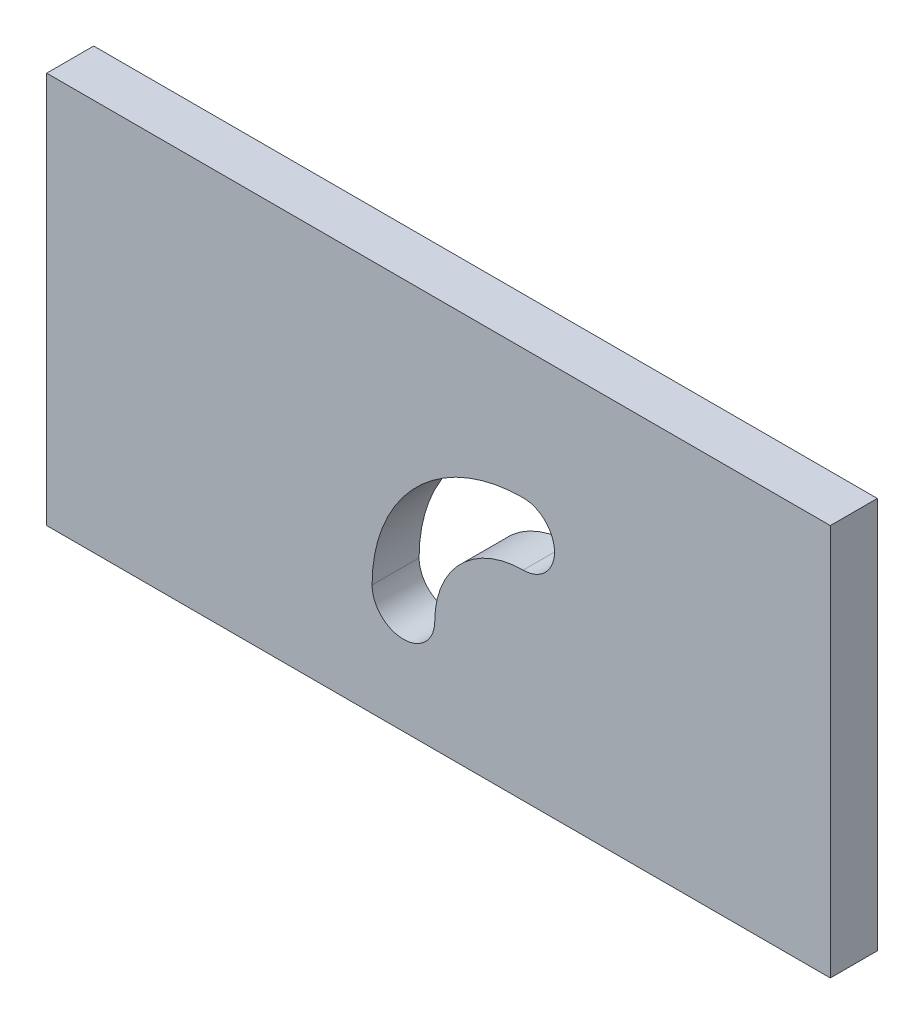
ISO-10303-21;
HEADER;
FILE_DESCRIPTION(('STEP AP214'),'2;1');
FILE_NAME('part.step','',(''),(''),'','','');
FILE_SCHEMA(('AUTOMOTIVE_DESIGN { 1 0 10303 214 1 1 1 1 }'));
ENDSEC;
DATA;
#1=APPLICATION_CONTEXT('core data for automotive mechanical design processes');
#2=APPLICATION_PROTOCOL_DEFINITION('international standard','automotive_design',2000,#1);
#3=PRODUCT_CONTEXT('',#1,'mechanical');
#4=PRODUCT('Part','Part','',(#3));
#5=PRODUCT_RELATED_PRODUCT_CATEGORY('part','',(#4));
#6=PRODUCT_DEFINITION_FORMATION('','',#4);
#7=PRODUCT_DEFINITION_CONTEXT('part definition',#1,'design');
#8=PRODUCT_DEFINITION('design','',#6,#7);
#9=PRODUCT_DEFINITION_SHAPE('','',#8);
#10=(LENGTH_UNIT() NAMED_UNIT(*) SI_UNIT(.MILLI.,.METRE.));
#11=(NAMED_UNIT(*) PLANE_ANGLE_UNIT() SI_UNIT($,.RADIAN.));
#12=(NAMED_UNIT(*) SI_UNIT($,.STERADIAN.) SOLID_ANGLE_UNIT());
#13=UNCERTAINTY_MEASURE_WITH_UNIT(LENGTH_MEASURE(1.E-05),#10,'distance_accuracy_value','');
#14=(GEOMETRIC_REPRESENTATION_CONTEXT(3) GLOBAL_UNCERTAINTY_ASSIGNED_CONTEXT((#13)) GLOBAL_UNIT_ASSIGNED_CONTEXT((#10,
#11,#12)) REPRESENTATION_CONTEXT('',''));
#15=CARTESIAN_POINT('',(0.,0.,0.));
#16=DIRECTION('',(0.,0.,1.));
#17=DIRECTION('',(1.,0.,0.));
#18=AXIS2_PLACEMENT_3D('',#15,#16,#17);
#19=CARTESIAN_POINT('',(0.,0.,3.));
#20=DIRECTION('',(0.,0.,1.));
#21=DIRECTION('',(1.,0.,0.));
#22=AXIS2_PLACEMENT_3D('',#19,#20,#21);
#23=PLANE('',#22);
#24=DIRECTION('',(0.,-1.,0.));
#25=VECTOR('',#24,1.);
#26=CARTESIAN_POINT('',(0.,25.,3.));
#27=LINE('',#26,#25);
#28=CARTESIAN_POINT('',(0.,25.,3.));
#29=VERTEX_POINT('',#28);
#30=CARTESIAN_POINT('',(0.,0.,3.));
#31=VERTEX_POINT('',#30);
#32=EDGE_CURVE('E138',#29,#31,#27,.T.);
#33=ORIENTED_EDGE('',*,*,#32,.T.);
#34=DIRECTION('',(1.,0.,0.));
#35=VECTOR('',#34,1.);
#36=CARTESIAN_POINT('',(0.,0.,3.));
#37=LINE('',#36,#35);
#38=CARTESIAN_POINT('',(50.,0.,3.));
#39=VERTEX_POINT('',#38);
#40=EDGE_CURVE('E141',#31,#39,#37,.T.);
#41=ORIENTED_EDGE('',*,*,#40,.T.);
#42=DIRECTION('',(0.,1.,0.));
#43=VECTOR('',#42,1.);
#44=CARTESIAN_POINT('',(50.,0.,3.));
#45=LINE('',#44,#43);
#46=CARTESIAN_POINT('',(50.,25.,3.));
#47=VERTEX_POINT('',#46);
#48=EDGE_CURVE('E143',#39,#47,#45,.T.);
#49=ORIENTED_EDGE('',*,*,#48,.T.);
#50=DIRECTION('',(-1.,0.,0.));
#51=VECTOR('',#50,1.);
#52=CARTESIAN_POINT('',(50.,25.,3.));
#53=LINE('',#52,#51);
#54=EDGE_CURVE('E145',#47,#29,#53,.T.);
#55=ORIENTED_EDGE('',*,*,#54,.T.);
#56=EDGE_LOOP('',(#33,#41,#49,#55));
#57=FACE_BOUND('',#56,.T.);
#58=CARTESIAN_POINT('',(30.4018978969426,7.09810210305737,3.));
#59=DIRECTION('',(0.,0.,-1.));
#60=DIRECTION('',(-1.,0.,0.));
#61=AXIS2_PLACEMENT_3D('',#58,#59,#60);
#62=CIRCLE('',#61,5.63943726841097);
#63=CARTESIAN_POINT('',(24.7624606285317,7.09810210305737,3.));
#64=VERTEX_POINT('',#63);
#65=CARTESIAN_POINT('',(30.4018978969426,12.7375393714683,3.));
#66=VERTEX_POINT('',#65);
#67=EDGE_CURVE('E120',#64,#66,#62,.T.);
#68=ORIENTED_EDGE('',*,*,#67,.F.);
#69=CARTESIAN_POINT('',(22.7624606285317,7.09810210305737,3.));
#70=DIRECTION('',(0.,0.,1.));
#71=DIRECTION('',(-1.,0.,0.));
#72=AXIS2_PLACEMENT_3D('',#69,#70,#71);
#73=CIRCLE('',#72,2.);
#74=CARTESIAN_POINT('',(20.7624606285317,7.09810210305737,3.));
#75=VERTEX_POINT('',#74);
#76=EDGE_CURVE('E109',#75,#64,#73,.T.);
#77=ORIENTED_EDGE('',*,*,#76,.F.);
#78=CARTESIAN_POINT('',(30.4018978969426,7.09810210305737,3.));
#79=DIRECTION('',(0.,0.,1.));
#80=DIRECTION('',(-1.,0.,0.));
#81=AXIS2_PLACEMENT_3D('',#78,#79,#80);
#82=CIRCLE('',#81,9.63943726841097);
#83=CARTESIAN_POINT('',(30.4018978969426,16.7375393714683,3.));
#84=VERTEX_POINT('',#83);
#85=EDGE_CURVE('E124',#84,#75,#82,.T.);
#86=ORIENTED_EDGE('',*,*,#85,.F.);
#87=CARTESIAN_POINT('',(30.4018978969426,14.7375393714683,3.));
#88=DIRECTION('',(0.,0.,1.));
#89=DIRECTION('',(1.,0.,0.));
#90=AXIS2_PLACEMENT_3D('',#87,#88,#89);
#91=CIRCLE('',#90,2.);
#92=EDGE_CURVE('E122',#66,#84,#91,.T.);
#93=ORIENTED_EDGE('',*,*,#92,.F.);
#94=EDGE_LOOP('',(#68,#77,#86,#93));
#95=FACE_BOUND('',#94,.T.);
#96=ADVANCED_FACE('F29',(#57,#95),#23,.T.);
#97=CARTESIAN_POINT('',(0.,0.,0.));
#98=DIRECTION('',(0.,0.,1.));
#99=DIRECTION('',(1.,0.,0.));
#100=AXIS2_PLACEMENT_3D('',#97,#98,#99);
#101=PLANE('',#100);
#102=DIRECTION('',(0.,-1.,0.));
#103=VECTOR('',#102,1.);
#104=CARTESIAN_POINT('',(0.,25.,0.));
#105=LINE('',#104,#103);
#106=CARTESIAN_POINT('',(0.,25.,0.));
#107=VERTEX_POINT('',#106);
#108=CARTESIAN_POINT('',(0.,0.,0.));
#109=VERTEX_POINT('',#108);
#110=EDGE_CURVE('E110',#107,#109,#105,.T.);
#111=ORIENTED_EDGE('',*,*,#110,.F.);
#112=DIRECTION('',(-1.,0.,0.));
#113=VECTOR('',#112,1.);
#114=CARTESIAN_POINT('',(50.,25.,0.));
#115=LINE('',#114,#113);
#116=CARTESIAN_POINT('',(50.,25.,0.));
#117=VERTEX_POINT('',#116);
#118=EDGE_CURVE('E136',#117,#107,#115,.T.);
#119=ORIENTED_EDGE('',*,*,#118,.F.);
#120=DIRECTION('',(0.,1.,0.));
#121=VECTOR('',#120,1.);
#122=CARTESIAN_POINT('',(50.,0.,0.));
#123=LINE('',#122,#121);
#124=CARTESIAN_POINT('',(50.,0.,0.));
#125=VERTEX_POINT('',#124);
#126=EDGE_CURVE('E134',#125,#117,#123,.T.);
#127=ORIENTED_EDGE('',*,*,#126,.F.);
#128=DIRECTION('',(1.,0.,0.));
#129=VECTOR('',#128,1.);
#130=CARTESIAN_POINT('',(0.,0.,0.));
#131=LINE('',#130,#129);
#132=EDGE_CURVE('E132',#109,#125,#131,.T.);
#133=ORIENTED_EDGE('',*,*,#132,.F.);
#134=EDGE_LOOP('',(#111,#119,#127,#133));
#135=FACE_BOUND('',#134,.T.);
#136=CARTESIAN_POINT('',(22.7624606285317,7.09810210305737,0.));
#137=DIRECTION('',(0.,0.,1.));
#138=DIRECTION('',(-1.,0.,0.));
#139=AXIS2_PLACEMENT_3D('',#136,#137,#138);
#140=CIRCLE('',#139,2.);
#141=CARTESIAN_POINT('',(20.7624606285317,7.09810210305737,0.));
#142=VERTEX_POINT('',#141);
#143=CARTESIAN_POINT('',(24.7624606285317,7.09810210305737,0.));
#144=VERTEX_POINT('',#143);
#145=EDGE_CURVE('E52',#142,#144,#140,.T.);
#146=ORIENTED_EDGE('',*,*,#145,.T.);
#147=CARTESIAN_POINT('',(30.4018978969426,7.09810210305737,0.));
#148=DIRECTION('',(0.,0.,-1.));
#149=DIRECTION('',(-1.,0.,0.));
#150=AXIS2_PLACEMENT_3D('',#147,#148,#149);
#151=CIRCLE('',#150,5.63943726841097);
#152=CARTESIAN_POINT('',(30.4018978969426,12.7375393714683,0.));
#153=VERTEX_POINT('',#152);
#154=EDGE_CURVE('E96',#144,#153,#151,.T.);
#155=ORIENTED_EDGE('',*,*,#154,.T.);
#156=CARTESIAN_POINT('',(30.4018978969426,14.7375393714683,0.));
#157=DIRECTION('',(0.,0.,1.));
#158=DIRECTION('',(1.,0.,0.));
#159=AXIS2_PLACEMENT_3D('',#156,#157,#158);
#160=CIRCLE('',#159,2.);
#161=CARTESIAN_POINT('',(30.4018978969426,16.7375393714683,0.));
#162=VERTEX_POINT('',#161);
#163=EDGE_CURVE('E105',#153,#162,#160,.T.);
#164=ORIENTED_EDGE('',*,*,#163,.T.);
#165=CARTESIAN_POINT('',(30.4018978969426,7.09810210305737,0.));
#166=DIRECTION('',(0.,0.,1.));
#167=DIRECTION('',(-1.,0.,0.));
#168=AXIS2_PLACEMENT_3D('',#165,#166,#167);
#169=CIRCLE('',#168,9.63943726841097);
#170=EDGE_CURVE('E114',#162,#142,#169,.T.);
#171=ORIENTED_EDGE('',*,*,#170,.T.);
#172=EDGE_LOOP('',(#146,#155,#164,#171));
#173=FACE_BOUND('',#172,.T.);
#174=ADVANCED_FACE('F113',(#135,#173),#101,.F.);
#175=CARTESIAN_POINT('',(0.,25.,3.));
#176=DIRECTION('',(1.,0.,0.));
#177=DIRECTION('',(0.,1.,0.));
#178=AXIS2_PLACEMENT_3D('',#175,#176,#177);
#179=PLANE('',#178);
#180=ORIENTED_EDGE('',*,*,#110,.T.);
#181=DIRECTION('',(0.,0.,-1.));
#182=VECTOR('',#181,1.);
#183=CARTESIAN_POINT('',(0.,0.,3.));
#184=LINE('',#183,#182);
#185=EDGE_CURVE('E11',#31,#109,#184,.T.);
#186=ORIENTED_EDGE('',*,*,#185,.F.);
#187=ORIENTED_EDGE('',*,*,#32,.F.);
#188=DIRECTION('',(0.,0.,-1.));
#189=VECTOR('',#188,1.);
#190=CARTESIAN_POINT('',(0.,25.,3.));
#191=LINE('',#190,#189);
#192=EDGE_CURVE('E147',#29,#107,#191,.T.);
#193=ORIENTED_EDGE('',*,*,#192,.T.);
#194=EDGE_LOOP('',(#180,#186,#187,#193));
#195=FACE_BOUND('',#194,.T.);
#196=ADVANCED_FACE('F31',(#195),#179,.F.);
#197=CARTESIAN_POINT('',(0.,0.,3.));
#198=DIRECTION('',(0.,1.,0.));
#199=DIRECTION('',(0.,0.,1.));
#200=AXIS2_PLACEMENT_3D('',#197,#198,#199);
#201=PLANE('',#200);
#202=ORIENTED_EDGE('',*,*,#132,.T.);
#203=DIRECTION('',(0.,0.,-1.));
#204=VECTOR('',#203,1.);
#205=CARTESIAN_POINT('',(50.,0.,3.));
#206=LINE('',#205,#204);
#207=EDGE_CURVE('E37',#39,#125,#206,.T.);
#208=ORIENTED_EDGE('',*,*,#207,.F.);
#209=ORIENTED_EDGE('',*,*,#40,.F.);
#210=ORIENTED_EDGE('',*,*,#185,.T.);
#211=EDGE_LOOP('',(#202,#208,#209,#210));
#212=FACE_BOUND('',#211,.T.);
#213=ADVANCED_FACE('F172',(#212),#201,.F.);
#214=CARTESIAN_POINT('',(50.,0.,3.));
#215=DIRECTION('',(-1.,0.,0.));
#216=DIRECTION('',(0.,0.,1.));
#217=AXIS2_PLACEMENT_3D('',#214,#215,#216);
#218=PLANE('',#217);
#219=ORIENTED_EDGE('',*,*,#126,.T.);
#220=DIRECTION('',(0.,0.,-1.));
#221=VECTOR('',#220,1.);
#222=CARTESIAN_POINT('',(50.,25.,3.));
#223=LINE('',#222,#221);
#224=EDGE_CURVE('E150',#47,#117,#223,.T.);
#225=ORIENTED_EDGE('',*,*,#224,.F.);
#226=ORIENTED_EDGE('',*,*,#48,.F.);
#227=ORIENTED_EDGE('',*,*,#207,.T.);
#228=EDGE_LOOP('',(#219,#225,#226,#227));
#229=FACE_BOUND('',#228,.T.);
#230=ADVANCED_FACE('F157',(#229),#218,.F.);
#231=CARTESIAN_POINT('',(50.,25.,3.));
#232=DIRECTION('',(0.,-1.,0.));
#233=DIRECTION('',(1.,0.,0.));
#234=AXIS2_PLACEMENT_3D('',#231,#232,#233);
#235=PLANE('',#234);
#236=ORIENTED_EDGE('',*,*,#118,.T.);
#237=ORIENTED_EDGE('',*,*,#192,.F.);
#238=ORIENTED_EDGE('',*,*,#54,.F.);
#239=ORIENTED_EDGE('',*,*,#224,.T.);
#240=EDGE_LOOP('',(#236,#237,#238,#239));
#241=FACE_BOUND('',#240,.T.);
#242=ADVANCED_FACE('F165',(#241),#235,.F.);
#243=CARTESIAN_POINT('',(22.7624606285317,7.09810210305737,3.));
#244=DIRECTION('',(0.,0.,-1.));
#245=DIRECTION('',(-1.,0.,0.));
#246=AXIS2_PLACEMENT_3D('',#243,#244,#245);
#247=CYLINDRICAL_SURFACE('',#246,2.);
#248=ORIENTED_EDGE('',*,*,#145,.F.);
#249=DIRECTION('',(0.,0.,-1.));
#250=VECTOR('',#249,1.);
#251=CARTESIAN_POINT('',(20.7624606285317,7.09810210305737,3.));
#252=LINE('',#251,#250);
#253=EDGE_CURVE('E126',#75,#142,#252,.T.);
#254=ORIENTED_EDGE('',*,*,#253,.F.);
#255=ORIENTED_EDGE('',*,*,#76,.T.);
#256=DIRECTION('',(0.,0.,-1.));
#257=VECTOR('',#256,1.);
#258=CARTESIAN_POINT('',(24.7624606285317,7.09810210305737,3.));
#259=LINE('',#258,#257);
#260=EDGE_CURVE('E98',#64,#144,#259,.T.);
#261=ORIENTED_EDGE('',*,*,#260,.T.);
#262=EDGE_LOOP('',(#248,#254,#255,#261));
#263=FACE_BOUND('',#262,.T.);
#264=ADVANCED_FACE('F107',(#263),#247,.F.);
#265=CARTESIAN_POINT('',(30.4018978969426,7.09810210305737,3.));
#266=DIRECTION('',(0.,0.,-1.));
#267=DIRECTION('',(-1.,0.,0.));
#268=AXIS2_PLACEMENT_3D('',#265,#266,#267);
#269=CYLINDRICAL_SURFACE('',#268,5.63943726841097);
#270=ORIENTED_EDGE('',*,*,#154,.F.);
#271=ORIENTED_EDGE('',*,*,#260,.F.);
#272=ORIENTED_EDGE('',*,*,#67,.T.);
#273=DIRECTION('',(0.,0.,-1.));
#274=VECTOR('',#273,1.);
#275=CARTESIAN_POINT('',(30.4018978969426,12.7375393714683,3.));
#276=LINE('',#275,#274);
#277=EDGE_CURVE('E101',#66,#153,#276,.T.);
#278=ORIENTED_EDGE('',*,*,#277,.T.);
#279=EDGE_LOOP('',(#270,#271,#272,#278));
#280=FACE_BOUND('',#279,.T.);
#281=ADVANCED_FACE('F97',(#280),#269,.T.);
#282=CARTESIAN_POINT('',(30.4018978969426,14.7375393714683,3.));
#283=DIRECTION('',(0.,0.,-1.));
#284=DIRECTION('',(-1.,0.,0.));
#285=AXIS2_PLACEMENT_3D('',#282,#283,#284);
#286=CYLINDRICAL_SURFACE('',#285,2.);
#287=ORIENTED_EDGE('',*,*,#163,.F.);
#288=ORIENTED_EDGE('',*,*,#277,.F.);
#289=ORIENTED_EDGE('',*,*,#92,.T.);
#290=DIRECTION('',(0.,0.,-1.));
#291=VECTOR('',#290,1.);
#292=CARTESIAN_POINT('',(30.4018978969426,16.7375393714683,3.));
#293=LINE('',#292,#291);
#294=EDGE_CURVE('E44',#84,#162,#293,.T.);
#295=ORIENTED_EDGE('',*,*,#294,.T.);
#296=EDGE_LOOP('',(#287,#288,#289,#295));
#297=FACE_BOUND('',#296,.T.);
#298=ADVANCED_FACE('F194',(#297),#286,.F.);
#299=CARTESIAN_POINT('',(30.4018978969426,7.09810210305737,3.));
#300=DIRECTION('',(0.,0.,-1.));
#301=DIRECTION('',(-1.,0.,0.));
#302=AXIS2_PLACEMENT_3D('',#299,#300,#301);
#303=CYLINDRICAL_SURFACE('',#302,9.63943726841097);
#304=ORIENTED_EDGE('',*,*,#170,.F.);
#305=ORIENTED_EDGE('',*,*,#294,.F.);
#306=ORIENTED_EDGE('',*,*,#85,.T.);
#307=ORIENTED_EDGE('',*,*,#253,.T.);
#308=EDGE_LOOP('',(#304,#305,#306,#307));
#309=FACE_BOUND('',#308,.T.);
#310=ADVANCED_FACE('F199',(#309),#303,.F.);
#311=CLOSED_SHELL('',(#96,#174,#196,#213,#230,#242,#264,#281,#298,#310));
#312=MANIFOLD_SOLID_BREP('B2',#311);
#313=ADVANCED_BREP_SHAPE_REPRESENTATION('',(#18,#312),#14);
#314=SHAPE_DEFINITION_REPRESENTATION(#9,#313);
ENDSEC;
END-ISO-10303-21;
